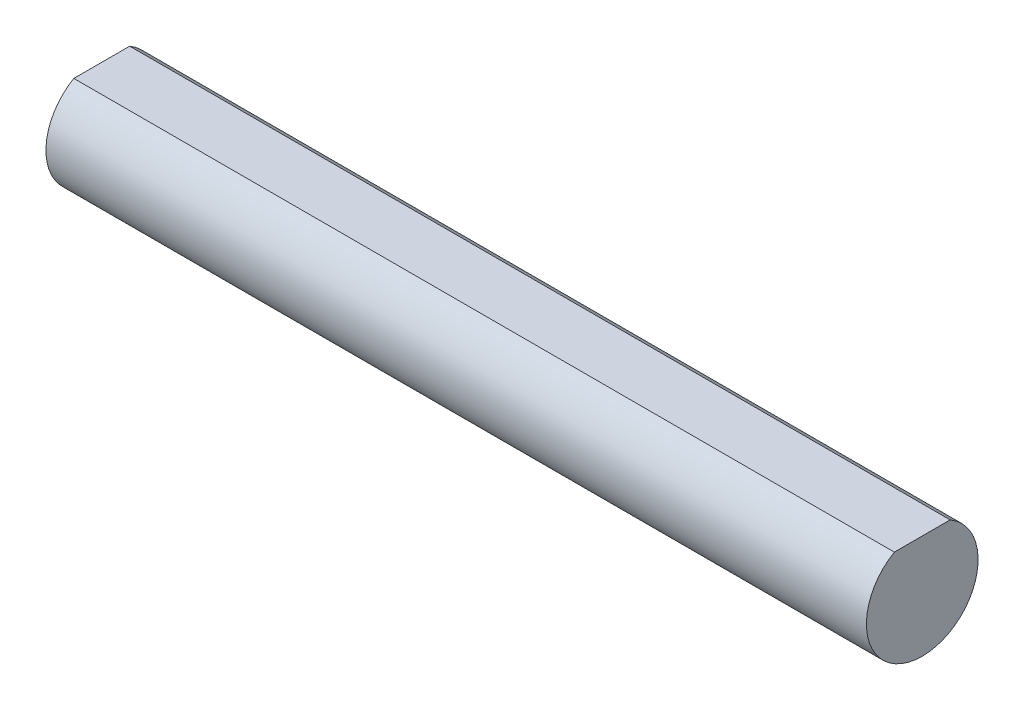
from build123d import *

# Parameters (mm, degrees)
BOSS_EXTRUDE1_DEPTH = 44.1


with BuildPart() as part:
    # Sketch1 → Boss-Extrude1 (new body)
    with BuildSketch(Plane(origin=(0, 0, 0), x_dir=(0, 0, -1), z_dir=(1, 0, 0))):
        with BuildLine():
            Line((1.5, 2.598076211), (-1.5, 2.598076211))
            ThreePointArc((-1.5, 2.598076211), (0, -3), (1.5, 2.598076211))
        make_face()
    extrude(amount=BOSS_EXTRUDE1_DEPTH)


solid = part.part
